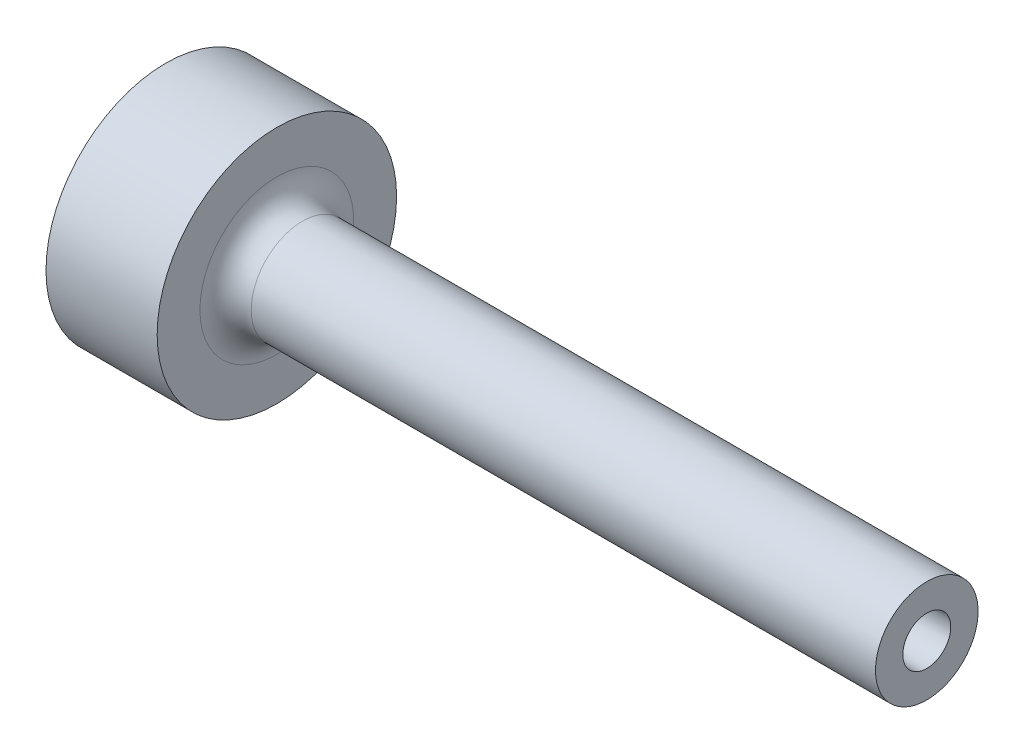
ISO-10303-21;
HEADER;
FILE_DESCRIPTION(('STEP AP214'),'2;1');
FILE_NAME('part.step','',(''),(''),'','','');
FILE_SCHEMA(('AUTOMOTIVE_DESIGN { 1 0 10303 214 1 1 1 1 }'));
ENDSEC;
DATA;
#1=APPLICATION_CONTEXT('core data for automotive mechanical design processes');
#2=APPLICATION_PROTOCOL_DEFINITION('international standard','automotive_design',2000,#1);
#3=PRODUCT_CONTEXT('',#1,'mechanical');
#4=PRODUCT('Part','Part','',(#3));
#5=PRODUCT_RELATED_PRODUCT_CATEGORY('part','',(#4));
#6=PRODUCT_DEFINITION_FORMATION('','',#4);
#7=PRODUCT_DEFINITION_CONTEXT('part definition',#1,'design');
#8=PRODUCT_DEFINITION('design','',#6,#7);
#9=PRODUCT_DEFINITION_SHAPE('','',#8);
#10=(LENGTH_UNIT() NAMED_UNIT(*) SI_UNIT(.MILLI.,.METRE.));
#11=(NAMED_UNIT(*) PLANE_ANGLE_UNIT() SI_UNIT($,.RADIAN.));
#12=(NAMED_UNIT(*) SI_UNIT($,.STERADIAN.) SOLID_ANGLE_UNIT());
#13=UNCERTAINTY_MEASURE_WITH_UNIT(LENGTH_MEASURE(1.E-05),#10,'distance_accuracy_value','');
#14=(GEOMETRIC_REPRESENTATION_CONTEXT(3) GLOBAL_UNCERTAINTY_ASSIGNED_CONTEXT((#13)) GLOBAL_UNIT_ASSIGNED_CONTEXT((#10,
#11,#12)) REPRESENTATION_CONTEXT('',''));
#15=CARTESIAN_POINT('',(0.,0.,0.));
#16=DIRECTION('',(0.,0.,1.));
#17=DIRECTION('',(1.,0.,0.));
#18=AXIS2_PLACEMENT_3D('',#15,#16,#17);
#19=CARTESIAN_POINT('',(0.,0.,0.));
#20=DIRECTION('',(-1.,0.,0.));
#21=DIRECTION('',(0.,0.,1.));
#22=AXIS2_PLACEMENT_3D('',#19,#20,#21);
#23=CYLINDRICAL_SURFACE('',#22,14.);
#24=CARTESIAN_POINT('',(13.,0.,0.));
#25=DIRECTION('',(-1.,0.,0.));
#26=DIRECTION('',(0.,0.,1.));
#27=AXIS2_PLACEMENT_3D('',#24,#25,#26);
#28=CIRCLE('',#27,14.);
#29=CARTESIAN_POINT('',(13.,0.,14.));
#30=VERTEX_POINT('',#29);
#31=EDGE_CURVE('E89',#30,#30,#28,.T.);
#32=ORIENTED_EDGE('',*,*,#31,.T.);
#33=EDGE_LOOP('',(#32));
#34=FACE_BOUND('',#33,.T.);
#35=CARTESIAN_POINT('',(0.,0.,0.));
#36=DIRECTION('',(-1.,0.,0.));
#37=DIRECTION('',(0.,0.,1.));
#38=AXIS2_PLACEMENT_3D('',#35,#36,#37);
#39=CIRCLE('',#38,14.);
#40=CARTESIAN_POINT('',(0.,0.,14.));
#41=VERTEX_POINT('',#40);
#42=EDGE_CURVE('E84',#41,#41,#39,.T.);
#43=ORIENTED_EDGE('',*,*,#42,.F.);
#44=EDGE_LOOP('',(#43));
#45=FACE_BOUND('',#44,.T.);
#46=CARTESIAN_POINT('',(6.5,-13.856406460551,-2.));
#47=CARTESIAN_POINT('',(6.61172417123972,-13.8564082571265,-1.99999534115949));
#48=CARTESIAN_POINT('',(6.72351471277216,-13.8577723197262,-1.99060664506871));
#49=CARTESIAN_POINT('',(6.9439746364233,-13.8630779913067,-1.95330740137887));
#50=CARTESIAN_POINT('',(7.05264079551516,-13.8670221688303,-1.92537839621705));
#51=CARTESIAN_POINT('',(7.26362870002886,-13.8770324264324,-1.85184738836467));
#52=CARTESIAN_POINT('',(7.36595507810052,-13.8830969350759,-1.80625847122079));
#53=CARTESIAN_POINT('',(7.56148972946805,-13.8966626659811,-1.69873175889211));
#54=CARTESIAN_POINT('',(7.65469934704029,-13.9041636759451,-1.63679637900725));
#55=CARTESIAN_POINT('',(7.83004829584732,-13.9198182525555,-1.49785346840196));
#56=CARTESIAN_POINT('',(7.91211171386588,-13.9279757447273,-1.42075056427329));
#57=CARTESIAN_POINT('',(8.06218155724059,-13.9439890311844,-1.25386707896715));
#58=CARTESIAN_POINT('',(8.13018723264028,-13.9518448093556,-1.16408582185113));
#59=CARTESIAN_POINT('',(8.25048909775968,-13.9664103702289,-0.973910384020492));
#60=CARTESIAN_POINT('',(8.30271571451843,-13.9731150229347,-0.873471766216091));
#61=CARTESIAN_POINT('',(8.38953073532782,-13.9845795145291,-0.665136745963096));
#62=CARTESIAN_POINT('',(8.4241199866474,-13.9893394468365,-0.557240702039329));
#63=CARTESIAN_POINT('',(8.47444920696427,-13.9963505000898,-0.337834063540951));
#64=CARTESIAN_POINT('',(8.49031606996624,-13.9986185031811,-0.226353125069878));
#65=CARTESIAN_POINT('',(8.5031438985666,-14.0004479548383,-0.00228956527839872));
#66=CARTESIAN_POINT('',(8.50010582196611,-14.0000095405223,0.110292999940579));
#67=CARTESIAN_POINT('',(8.47531062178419,-13.9964890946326,0.33249899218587));
#68=CARTESIAN_POINT('',(8.45369000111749,-13.9934263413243,0.442137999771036));
#69=CARTESIAN_POINT('',(8.39255744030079,-13.9850228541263,0.656215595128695));
#70=CARTESIAN_POINT('',(8.3530450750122,-13.9796820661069,0.760654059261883));
#71=CARTESIAN_POINT('',(8.25710925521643,-13.9672894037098,0.961781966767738));
#72=CARTESIAN_POINT('',(8.20062784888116,-13.9602316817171,1.05844339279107));
#73=CARTESIAN_POINT('',(8.07239950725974,-13.9451926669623,1.24096782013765));
#74=CARTESIAN_POINT('',(8.00065165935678,-13.9372113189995,1.32683017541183));
#75=CARTESIAN_POINT('',(7.843165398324,-13.921132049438,1.48612299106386));
#76=CARTESIAN_POINT('',(7.75730786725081,-13.9130337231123,1.55943569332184));
#77=CARTESIAN_POINT('',(7.57444547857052,-13.8977029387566,1.69062989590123));
#78=CARTESIAN_POINT('',(7.47744056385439,-13.890470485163,1.74851131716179));
#79=CARTESIAN_POINT('',(7.27491971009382,-13.8776905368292,1.84721301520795));
#80=CARTESIAN_POINT('',(7.1693981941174,-13.8721441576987,1.88802200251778));
#81=CARTESIAN_POINT('',(6.95290242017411,-13.8633846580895,1.9513062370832));
#82=CARTESIAN_POINT('',(6.84192850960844,-13.8601713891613,1.97378265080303));
#83=CARTESIAN_POINT('',(6.61872346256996,-13.8564698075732,1.99960390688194));
#84=CARTESIAN_POINT('',(6.50651197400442,-13.8559577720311,2.00311531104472));
#85=CARTESIAN_POINT('',(6.28310219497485,-13.8576537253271,1.9913480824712));
#86=CARTESIAN_POINT('',(6.17190387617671,-13.8598616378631,1.9760699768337));
#87=CARTESIAN_POINT('',(5.95418781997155,-13.8667269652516,1.92729837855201));
#88=CARTESIAN_POINT('',(5.84765127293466,-13.8713733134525,1.8938871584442));
#89=CARTESIAN_POINT('',(5.6416912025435,-13.8825829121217,1.80988306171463));
#90=CARTESIAN_POINT('',(5.54226800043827,-13.8891462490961,1.75928940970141));
#91=CARTESIAN_POINT('',(5.35260812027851,-13.9035064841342,1.64195360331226));
#92=CARTESIAN_POINT('',(5.26243903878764,-13.911311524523,1.57510320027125));
#93=CARTESIAN_POINT('',(5.09454027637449,-13.9272509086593,1.42730277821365));
#94=CARTESIAN_POINT('',(5.01681123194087,-13.9353852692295,1.34635203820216));
#95=CARTESIAN_POINT('',(4.8754047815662,-13.9511405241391,1.17191708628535));
#96=CARTESIAN_POINT('',(4.81183747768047,-13.9587570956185,1.07834317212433));
#97=CARTESIAN_POINT('',(4.70132443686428,-13.972552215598,0.881748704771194));
#98=CARTESIAN_POINT('',(4.65437828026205,-13.9787308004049,0.778728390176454));
#99=CARTESIAN_POINT('',(4.57861788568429,-13.9889347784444,0.566515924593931));
#100=CARTESIAN_POINT('',(4.54974241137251,-13.9929674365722,0.457345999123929));
#101=CARTESIAN_POINT('',(4.51074453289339,-13.9984555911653,0.235645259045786));
#102=CARTESIAN_POINT('',(4.50062101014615,-13.9999112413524,0.123114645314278));
#103=CARTESIAN_POINT('',(4.49943976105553,-14.0000800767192,-0.101043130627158));
#104=CARTESIAN_POINT('',(4.50821318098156,-13.998817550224,-0.212669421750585));
#105=CARTESIAN_POINT('',(4.54421615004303,-13.9937406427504,-0.432842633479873));
#106=CARTESIAN_POINT('',(4.57144565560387,-13.989926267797,-0.541389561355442));
#107=CARTESIAN_POINT('',(4.6435299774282,-13.9801722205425,-0.752283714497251));
#108=CARTESIAN_POINT('',(4.68837418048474,-13.9742338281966,-0.854634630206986));
#109=CARTESIAN_POINT('',(4.79439714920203,-13.960885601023,-1.05038570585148));
#110=CARTESIAN_POINT('',(4.8555763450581,-13.9534757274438,-1.14378562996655));
#111=CARTESIAN_POINT('',(4.99314771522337,-13.9379304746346,-1.31984194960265));
#112=CARTESIAN_POINT('',(5.06966490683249,-13.9297894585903,-1.40240016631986));
#113=CARTESIAN_POINT('',(5.2354775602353,-13.9137422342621,-1.55356716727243));
#114=CARTESIAN_POINT('',(5.32477602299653,-13.9058360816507,-1.6221726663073));
#115=CARTESIAN_POINT('',(5.51414543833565,-13.8911108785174,-1.74379523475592));
#116=CARTESIAN_POINT('',(5.61426869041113,-13.8842975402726,-1.79673154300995));
#117=CARTESIAN_POINT('',(5.82203229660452,-13.8725962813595,-1.88495902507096));
#118=CARTESIAN_POINT('',(5.92966459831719,-13.8677063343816,-1.92026877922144));
#119=CARTESIAN_POINT('',(6.11483642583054,-13.8615529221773,-1.96409255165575));
#120=CARTESIAN_POINT('',(6.19122433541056,-13.859633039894,-1.97753762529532));
#121=CARTESIAN_POINT('',(6.34506419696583,-13.857059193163,-1.99549291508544));
#122=CARTESIAN_POINT('',(6.42251613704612,-13.8564052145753,-2.00000323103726));
#123=CARTESIAN_POINT('',(6.5,-13.856406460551,-2.));
#124=B_SPLINE_CURVE_WITH_KNOTS('',3,(#46,#47,#48,#49,#50,#51,#52,#53,#54,#55,#56,#57,#58,#59,
#60,#61,#62,#63,#64,#65,#66,#67,#68,#69,#70,#71,#72,#73,#74,#75,#76,#77,#78,#79,#80,#81,#82,#83,
#84,#85,#86,#87,#88,#89,#90,#91,#92,#93,#94,#95,#96,#97,#98,#99,#100,#101,#102,#103,#104,#105,
#106,#107,#108,#109,#110,#111,#112,#113,#114,#115,#116,#117,#118,#119,#120,#121,#122,#123),
.UNSPECIFIED.,.T.,.F.,(4,2,2,2,2,2,2,2,2,2,2,2,2,2,2,2,2,2,2,2,2,2,2,2,2,2,2,2,2,2,2,2,2,2,2,2,
2,2,4),(0.,0.334889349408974,0.670112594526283,1.00508792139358,1.34001378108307,
1.6771171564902,2.01423851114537,2.35282530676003,2.6913958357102,3.02765822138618,
3.36390357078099,3.69769984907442,4.03150405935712,4.36646147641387,4.70143892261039,
5.03940517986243,5.37737316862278,5.7155642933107,6.05373389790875,6.3889286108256,
6.72411392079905,7.05779100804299,7.39148315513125,7.72746121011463,8.06345644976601,
8.40197921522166,8.74049343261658,9.07785422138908,9.41519488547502,9.74953375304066,
10.083871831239,10.4180087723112,10.7521545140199,11.0891434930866,11.426211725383,
11.7649881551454,12.103406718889,12.3356645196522,12.5679197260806),.UNSPECIFIED.);
#125=CARTESIAN_POINT('',(6.5,-13.856406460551,-2.));
#126=VERTEX_POINT('',#125);
#127=EDGE_CURVE('E10',#126,#126,#124,.T.);
#128=ORIENTED_EDGE('',*,*,#127,.F.);
#129=EDGE_LOOP('',(#128));
#130=FACE_BOUND('',#129,.T.);
#131=ADVANCED_FACE('F16',(#34,#45,#130),#23,.T.);
#132=CARTESIAN_POINT('',(0.,0.,0.));
#133=DIRECTION('',(1.,0.,0.));
#134=DIRECTION('',(0.,0.,-1.));
#135=AXIS2_PLACEMENT_3D('',#132,#133,#134);
#136=CONICAL_SURFACE('',#135,1.25,0.0174532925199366);
#137=CARTESIAN_POINT('',(89.,0.,0.));
#138=DIRECTION('',(-1.,0.,0.));
#139=DIRECTION('',(0.,0.,1.));
#140=AXIS2_PLACEMENT_3D('',#137,#138,#139);
#141=CIRCLE('',#140,2.80350077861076);
#142=CARTESIAN_POINT('',(89.,0.,2.80350077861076));
#143=VERTEX_POINT('',#142);
#144=EDGE_CURVE('E81',#143,#143,#141,.T.);
#145=ORIENTED_EDGE('',*,*,#144,.F.);
#146=EDGE_LOOP('',(#145));
#147=FACE_BOUND('',#146,.T.);
#148=CARTESIAN_POINT('',(1.22738614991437,0.,0.));
#149=DIRECTION('',(-1.,0.,0.));
#150=DIRECTION('',(0.,0.,1.));
#151=AXIS2_PLACEMENT_3D('',#148,#149,#150);
#152=CIRCLE('',#151,1.27142410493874);
#153=CARTESIAN_POINT('',(1.22738614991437,0.,1.27142410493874));
#154=VERTEX_POINT('',#153);
#155=EDGE_CURVE('E94',#154,#154,#152,.F.);
#156=ORIENTED_EDGE('',*,*,#155,.F.);
#157=EDGE_LOOP('',(#156));
#158=FACE_BOUND('',#157,.T.);
#159=ADVANCED_FACE('F45',(#147,#158),#136,.F.);
#160=CARTESIAN_POINT('',(16.,0.,0.));
#161=DIRECTION('',(-1.,0.,0.));
#162=DIRECTION('',(0.,0.,1.));
#163=AXIS2_PLACEMENT_3D('',#160,#161,#162);
#164=TOROIDAL_SURFACE('',#163,9.,3.);
#165=CARTESIAN_POINT('',(13.,0.,0.));
#166=DIRECTION('',(-1.,0.,0.));
#167=DIRECTION('',(0.,0.,1.));
#168=AXIS2_PLACEMENT_3D('',#165,#166,#167);
#169=CIRCLE('',#168,9.);
#170=CARTESIAN_POINT('',(13.,0.,9.));
#171=VERTEX_POINT('',#170);
#172=EDGE_CURVE('E91',#171,#171,#169,.T.);
#173=ORIENTED_EDGE('',*,*,#172,.F.);
#174=EDGE_LOOP('',(#173));
#175=FACE_BOUND('',#174,.T.);
#176=CARTESIAN_POINT('',(16.,0.,0.));
#177=DIRECTION('',(-1.,0.,0.));
#178=DIRECTION('',(0.,0.,1.));
#179=AXIS2_PLACEMENT_3D('',#176,#177,#178);
#180=CIRCLE('',#179,6.);
#181=CARTESIAN_POINT('',(16.,0.,6.));
#182=VERTEX_POINT('',#181);
#183=EDGE_CURVE('E28',#182,#182,#180,.T.);
#184=ORIENTED_EDGE('',*,*,#183,.T.);
#185=EDGE_LOOP('',(#184));
#186=FACE_BOUND('',#185,.T.);
#187=ADVANCED_FACE('F18',(#175,#186),#164,.F.);
#188=CARTESIAN_POINT('',(0.,0.,0.));
#189=DIRECTION('',(-1.,0.,0.));
#190=DIRECTION('',(0.,0.,1.));
#191=AXIS2_PLACEMENT_3D('',#188,#189,#190);
#192=CYLINDRICAL_SURFACE('',#191,6.);
#193=ORIENTED_EDGE('',*,*,#183,.F.);
#194=EDGE_LOOP('',(#193));
#195=FACE_BOUND('',#194,.T.);
#196=CARTESIAN_POINT('',(89.,0.,0.));
#197=DIRECTION('',(-1.,0.,0.));
#198=DIRECTION('',(0.,0.,1.));
#199=AXIS2_PLACEMENT_3D('',#196,#197,#198);
#200=CIRCLE('',#199,6.);
#201=CARTESIAN_POINT('',(89.,0.,6.));
#202=VERTEX_POINT('',#201);
#203=EDGE_CURVE('E80',#202,#202,#200,.T.);
#204=ORIENTED_EDGE('',*,*,#203,.T.);
#205=EDGE_LOOP('',(#204));
#206=FACE_BOUND('',#205,.T.);
#207=ADVANCED_FACE('F66',(#195,#206),#192,.T.);
#208=CARTESIAN_POINT('',(89.,6.,0.));
#209=DIRECTION('',(-1.,0.,0.));
#210=DIRECTION('',(0.,0.,1.));
#211=AXIS2_PLACEMENT_3D('',#208,#209,#210);
#212=PLANE('',#211);
#213=ORIENTED_EDGE('',*,*,#203,.F.);
#214=EDGE_LOOP('',(#213));
#215=FACE_BOUND('',#214,.T.);
#216=ORIENTED_EDGE('',*,*,#144,.T.);
#217=EDGE_LOOP('',(#216));
#218=FACE_BOUND('',#217,.T.);
#219=ADVANCED_FACE('F62',(#215,#218),#212,.F.);
#220=CARTESIAN_POINT('',(0.,1.25,0.));
#221=DIRECTION('',(1.,0.,0.));
#222=DIRECTION('',(0.,0.,-1.));
#223=AXIS2_PLACEMENT_3D('',#220,#221,#222);
#224=PLANE('',#223);
#225=CARTESIAN_POINT('',(0.,0.,0.));
#226=DIRECTION('',(-1.,0.,0.));
#227=DIRECTION('',(0.,0.,1.));
#228=AXIS2_PLACEMENT_3D('',#225,#226,#227);
#229=CIRCLE('',#228,5.);
#230=CARTESIAN_POINT('',(0.,0.,5.));
#231=VERTEX_POINT('',#230);
#232=EDGE_CURVE('E97',#231,#231,#229,.T.);
#233=ORIENTED_EDGE('',*,*,#232,.F.);
#234=EDGE_LOOP('',(#233));
#235=FACE_BOUND('',#234,.T.);
#236=ORIENTED_EDGE('',*,*,#42,.T.);
#237=EDGE_LOOP('',(#236));
#238=FACE_BOUND('',#237,.T.);
#239=ADVANCED_FACE('F60',(#235,#238),#224,.F.);
#240=CARTESIAN_POINT('',(13.,14.,0.));
#241=DIRECTION('',(-1.,0.,0.));
#242=DIRECTION('',(0.,0.,1.));
#243=AXIS2_PLACEMENT_3D('',#240,#241,#242);
#244=PLANE('',#243);
#245=ORIENTED_EDGE('',*,*,#31,.F.);
#246=EDGE_LOOP('',(#245));
#247=FACE_BOUND('',#246,.T.);
#248=ORIENTED_EDGE('',*,*,#172,.T.);
#249=EDGE_LOOP('',(#248));
#250=FACE_BOUND('',#249,.T.);
#251=ADVANCED_FACE('F58',(#247,#250),#244,.F.);
#252=CARTESIAN_POINT('',(-37.3349076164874,0.,0.));
#253=DIRECTION('',(-1.,0.,0.));
#254=DIRECTION('',(0.,0.,1.));
#255=AXIS2_PLACEMENT_3D('',#252,#253,#254);
#256=DEGENERATE_TOROIDAL_SURFACE('',#255,9.35634609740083,40.,.F.);
#257=ORIENTED_EDGE('',*,*,#232,.T.);
#258=EDGE_LOOP('',(#257));
#259=FACE_BOUND('',#258,.T.);
#260=ORIENTED_EDGE('',*,*,#155,.T.);
#261=EDGE_LOOP('',(#260));
#262=FACE_BOUND('',#261,.T.);
#263=ADVANCED_FACE('F41',(#259,#262),#256,.T.);
#264=CARTESIAN_POINT('',(6.5,-14.,0.));
#265=DIRECTION('',(0.,-1.,0.));
#266=DIRECTION('',(0.,0.,-1.));
#267=AXIS2_PLACEMENT_3D('',#264,#265,#266);
#268=CYLINDRICAL_SURFACE('',#267,2.);
#269=CARTESIAN_POINT('',(6.5,-8.,0.));
#270=DIRECTION('',(0.,-1.,0.));
#271=DIRECTION('',(0.,0.,-1.));
#272=AXIS2_PLACEMENT_3D('',#269,#270,#271);
#273=CIRCLE('',#272,2.);
#274=CARTESIAN_POINT('',(6.5,-8.,-2.));
#275=VERTEX_POINT('',#274);
#276=EDGE_CURVE('E100',#275,#275,#273,.T.);
#277=ORIENTED_EDGE('',*,*,#276,.F.);
#278=EDGE_LOOP('',(#277));
#279=FACE_BOUND('',#278,.T.);
#280=ORIENTED_EDGE('',*,*,#127,.T.);
#281=EDGE_LOOP('',(#280));
#282=FACE_BOUND('',#281,.T.);
#283=ADVANCED_FACE('F33',(#279,#282),#268,.F.);
#284=CARTESIAN_POINT('',(6.5,-6.84529946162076,0.));
#285=DIRECTION('',(0.,-1.,0.));
#286=DIRECTION('',(0.,0.,-1.));
#287=AXIS2_PLACEMENT_3D('',#284,#285,#286);
#288=CONICAL_SURFACE('',#287,0.,1.0471975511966);
#289=ORIENTED_EDGE('',*,*,#276,.T.);
#290=EDGE_LOOP('',(#289));
#291=FACE_BOUND('',#290,.T.);
#292=CARTESIAN_POINT('',(6.5,-6.84529946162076,0.));
#293=VERTEX_POINT('',#292);
#294=VERTEX_LOOP('',#293);
#295=FACE_BOUND('',#294,.T.);
#296=ADVANCED_FACE('F31',(#291,#295),#288,.F.);
#297=CLOSED_SHELL('',(#131,#159,#187,#207,#219,#239,#251,#263,#283,#296));
#298=MANIFOLD_SOLID_BREP('B1',#297);
#299=ADVANCED_BREP_SHAPE_REPRESENTATION('',(#18,#298),#14);
#300=SHAPE_DEFINITION_REPRESENTATION(#9,#299);
ENDSEC;
END-ISO-10303-21;
